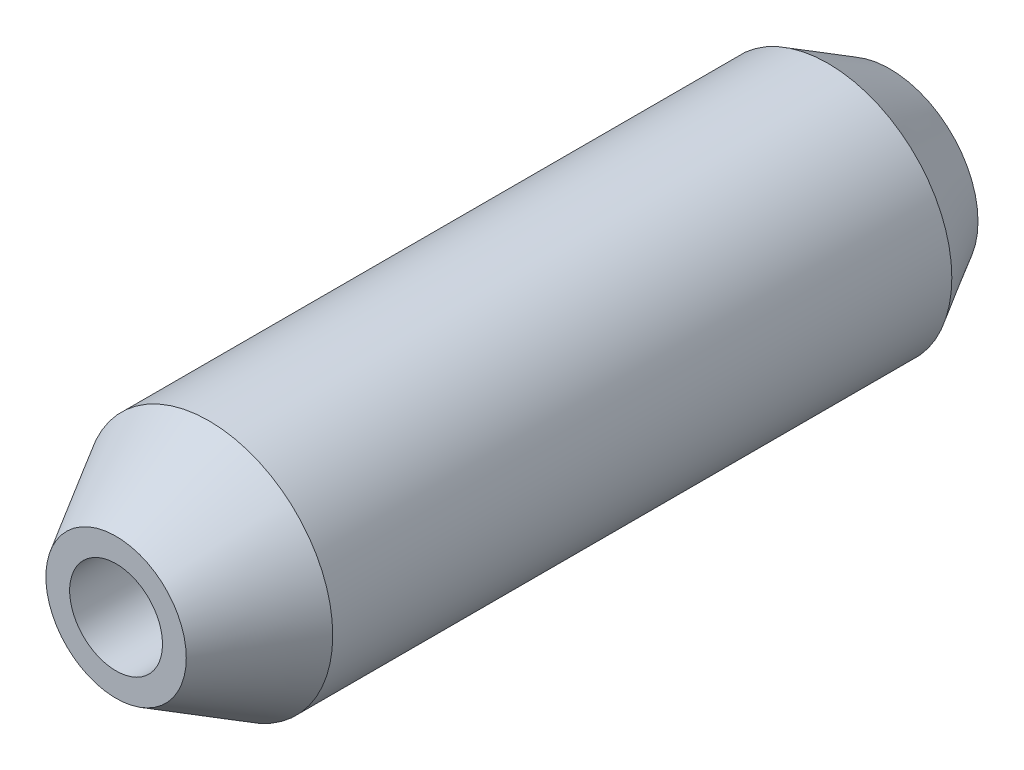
ISO-10303-21;
HEADER;
FILE_DESCRIPTION(('STEP AP214'),'2;1');
FILE_NAME('part.step','',(''),(''),'','','');
FILE_SCHEMA(('AUTOMOTIVE_DESIGN { 1 0 10303 214 1 1 1 1 }'));
ENDSEC;
DATA;
#1=APPLICATION_CONTEXT('core data for automotive mechanical design processes');
#2=APPLICATION_PROTOCOL_DEFINITION('international standard','automotive_design',2000,#1);
#3=PRODUCT_CONTEXT('',#1,'mechanical');
#4=PRODUCT('Part','Part','',(#3));
#5=PRODUCT_RELATED_PRODUCT_CATEGORY('part','',(#4));
#6=PRODUCT_DEFINITION_FORMATION('','',#4);
#7=PRODUCT_DEFINITION_CONTEXT('part definition',#1,'design');
#8=PRODUCT_DEFINITION('design','',#6,#7);
#9=PRODUCT_DEFINITION_SHAPE('','',#8);
#10=(LENGTH_UNIT() NAMED_UNIT(*) SI_UNIT(.MILLI.,.METRE.));
#11=(NAMED_UNIT(*) PLANE_ANGLE_UNIT() SI_UNIT($,.RADIAN.));
#12=(NAMED_UNIT(*) SI_UNIT($,.STERADIAN.) SOLID_ANGLE_UNIT());
#13=UNCERTAINTY_MEASURE_WITH_UNIT(LENGTH_MEASURE(1.E-05),#10,'distance_accuracy_value','');
#14=(GEOMETRIC_REPRESENTATION_CONTEXT(3) GLOBAL_UNCERTAINTY_ASSIGNED_CONTEXT((#13)) GLOBAL_UNIT_ASSIGNED_CONTEXT((#10,
#11,#12)) REPRESENTATION_CONTEXT('',''));
#15=CARTESIAN_POINT('',(0.,0.,0.));
#16=DIRECTION('',(0.,0.,1.));
#17=DIRECTION('',(1.,0.,0.));
#18=AXIS2_PLACEMENT_3D('',#15,#16,#17);
#19=CARTESIAN_POINT('',(0.,0.,0.));
#20=DIRECTION('',(0.,0.,1.));
#21=DIRECTION('',(1.,0.,0.));
#22=AXIS2_PLACEMENT_3D('',#19,#20,#21);
#23=PLANE('',#22);
#24=CARTESIAN_POINT('',(0.,0.,0.));
#25=DIRECTION('',(0.,0.,1.));
#26=DIRECTION('',(1.,0.,0.));
#27=AXIS2_PLACEMENT_3D('',#24,#25,#26);
#28=CIRCLE('',#27,2.84529946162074);
#29=CARTESIAN_POINT('',(2.84529946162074,0.,0.));
#30=VERTEX_POINT('',#29);
#31=EDGE_CURVE('E8',#30,#30,#28,.T.);
#32=ORIENTED_EDGE('',*,*,#31,.F.);
#33=EDGE_LOOP('',(#32));
#34=FACE_BOUND('',#33,.T.);
#35=ADVANCED_FACE('F13',(#34),#23,.F.);
#36=CARTESIAN_POINT('',(0.,0.,2.));
#37=DIRECTION('',(0.,0.,1.));
#38=DIRECTION('',(1.,0.,0.));
#39=AXIS2_PLACEMENT_3D('',#36,#37,#38);
#40=CONICAL_SURFACE('',#39,4.,0.523598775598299);
#41=ORIENTED_EDGE('',*,*,#31,.T.);
#42=EDGE_LOOP('',(#41));
#43=FACE_BOUND('',#42,.T.);
#44=CARTESIAN_POINT('',(0.,0.,2.));
#45=DIRECTION('',(0.,0.,1.));
#46=DIRECTION('',(1.,0.,0.));
#47=AXIS2_PLACEMENT_3D('',#44,#45,#46);
#48=CIRCLE('',#47,4.);
#49=CARTESIAN_POINT('',(4.,0.,2.));
#50=VERTEX_POINT('',#49);
#51=EDGE_CURVE('E19',#50,#50,#48,.T.);
#52=ORIENTED_EDGE('',*,*,#51,.F.);
#53=EDGE_LOOP('',(#52));
#54=FACE_BOUND('',#53,.T.);
#55=ADVANCED_FACE('F61',(#43,#54),#40,.T.);
#56=CARTESIAN_POINT('',(0.,0.,50.));
#57=DIRECTION('',(0.,0.,1.));
#58=DIRECTION('',(1.,0.,0.));
#59=AXIS2_PLACEMENT_3D('',#56,#57,#58);
#60=CYLINDRICAL_SURFACE('',#59,4.);
#61=CARTESIAN_POINT('',(0.,0.,22.));
#62=DIRECTION('',(0.,0.,1.));
#63=DIRECTION('',(1.,0.,0.));
#64=AXIS2_PLACEMENT_3D('',#61,#62,#63);
#65=CIRCLE('',#64,4.);
#66=CARTESIAN_POINT('',(4.,0.,22.));
#67=VERTEX_POINT('',#66);
#68=EDGE_CURVE('E23',#67,#67,#65,.T.);
#69=ORIENTED_EDGE('',*,*,#68,.F.);
#70=EDGE_LOOP('',(#69));
#71=FACE_BOUND('',#70,.T.);
#72=ORIENTED_EDGE('',*,*,#51,.T.);
#73=EDGE_LOOP('',(#72));
#74=FACE_BOUND('',#73,.T.);
#75=ADVANCED_FACE('F56',(#71,#74),#60,.T.);
#76=CARTESIAN_POINT('',(0.,0.,22.));
#77=DIRECTION('',(0.,0.,-1.));
#78=DIRECTION('',(-1.,0.,0.));
#79=AXIS2_PLACEMENT_3D('',#76,#77,#78);
#80=CONICAL_SURFACE('',#79,4.,0.523598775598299);
#81=CARTESIAN_POINT('',(0.,0.,25.));
#82=DIRECTION('',(0.,0.,1.));
#83=DIRECTION('',(1.,0.,0.));
#84=AXIS2_PLACEMENT_3D('',#81,#82,#83);
#85=CIRCLE('',#84,2.26794919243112);
#86=CARTESIAN_POINT('',(2.26794919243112,0.,25.));
#87=VERTEX_POINT('',#86);
#88=EDGE_CURVE('E27',#87,#87,#85,.T.);
#89=ORIENTED_EDGE('',*,*,#88,.F.);
#90=EDGE_LOOP('',(#89));
#91=FACE_BOUND('',#90,.T.);
#92=ORIENTED_EDGE('',*,*,#68,.T.);
#93=EDGE_LOOP('',(#92));
#94=FACE_BOUND('',#93,.T.);
#95=ADVANCED_FACE('F50',(#91,#94),#80,.T.);
#96=CARTESIAN_POINT('',(2.26794919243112,0.,25.));
#97=DIRECTION('',(0.,0.,-1.));
#98=DIRECTION('',(-1.,0.,0.));
#99=AXIS2_PLACEMENT_3D('',#96,#97,#98);
#100=PLANE('',#99);
#101=CARTESIAN_POINT('',(0.,0.,25.));
#102=DIRECTION('',(0.,0.,1.));
#103=DIRECTION('',(1.,0.,0.));
#104=AXIS2_PLACEMENT_3D('',#101,#102,#103);
#105=CIRCLE('',#104,1.5);
#106=CARTESIAN_POINT('',(1.5,0.,25.));
#107=VERTEX_POINT('',#106);
#108=EDGE_CURVE('E32',#107,#107,#105,.T.);
#109=ORIENTED_EDGE('',*,*,#108,.F.);
#110=EDGE_LOOP('',(#109));
#111=FACE_BOUND('',#110,.T.);
#112=ORIENTED_EDGE('',*,*,#88,.T.);
#113=EDGE_LOOP('',(#112));
#114=FACE_BOUND('',#113,.T.);
#115=ADVANCED_FACE('F44',(#111,#114),#100,.F.);
#116=CARTESIAN_POINT('',(0.,0.,50.));
#117=DIRECTION('',(0.,0.,1.));
#118=DIRECTION('',(1.,0.,0.));
#119=AXIS2_PLACEMENT_3D('',#116,#117,#118);
#120=CYLINDRICAL_SURFACE('',#119,1.5);
#121=CARTESIAN_POINT('',(0.,0.,19.));
#122=DIRECTION('',(0.,0.,1.));
#123=DIRECTION('',(1.,0.,0.));
#124=AXIS2_PLACEMENT_3D('',#121,#122,#123);
#125=CIRCLE('',#124,1.5);
#126=CARTESIAN_POINT('',(1.5,0.,19.));
#127=VERTEX_POINT('',#126);
#128=EDGE_CURVE('E35',#127,#127,#125,.T.);
#129=ORIENTED_EDGE('',*,*,#128,.F.);
#130=EDGE_LOOP('',(#129));
#131=FACE_BOUND('',#130,.T.);
#132=ORIENTED_EDGE('',*,*,#108,.T.);
#133=EDGE_LOOP('',(#132));
#134=FACE_BOUND('',#133,.T.);
#135=ADVANCED_FACE('F41',(#131,#134),#120,.F.);
#136=CARTESIAN_POINT('',(0.,0.,19.));
#137=DIRECTION('',(0.,0.,1.));
#138=DIRECTION('',(1.,0.,0.));
#139=AXIS2_PLACEMENT_3D('',#136,#137,#138);
#140=PLANE('',#139);
#141=ORIENTED_EDGE('',*,*,#128,.T.);
#142=EDGE_LOOP('',(#141));
#143=FACE_BOUND('',#142,.T.);
#144=ADVANCED_FACE('F39',(#143),#140,.T.);
#145=CLOSED_SHELL('',(#35,#55,#75,#95,#115,#135,#144));
#146=MANIFOLD_SOLID_BREP('B1',#145);
#147=ADVANCED_BREP_SHAPE_REPRESENTATION('',(#18,#146),#14);
#148=SHAPE_DEFINITION_REPRESENTATION(#9,#147);
ENDSEC;
END-ISO-10303-21;
